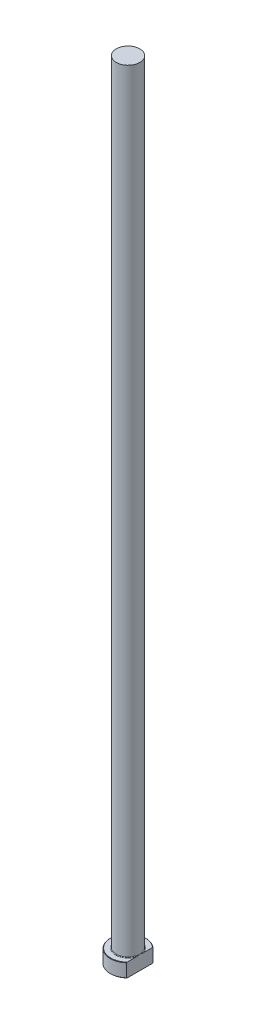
from build123d import *
from build123d.topology import SkipClean

# Parameters (mm, degrees)
CHAMFER1_SIZE = 0.2
FILLET1_R     = 0.3
KEY_DEPTH     = 401.202448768


with BuildPart() as part:
    # Sketch1 → Revolve1 (revolve)
    with BuildSketch(Plane.XY, mode=Mode.PRIVATE) as revolve1_sk:
        Polygon((0, 0), (-9, 0), (-9, 7), (-6, 7), (-6, 400), (0, 400), align=None)
    revolve(revolve1_sk.sketch.rotate(Axis((0, 259.958771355, 0), (0, -1, 0)), 270), axis=Axis((0, 259.958771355, 0), (0, -1, 0)))

    # Chamfer1
    chamfer1_edges = [part.edges().sort_by_distance(p)[0] for p in [
        (0, 7, -9),
        (0, 0, -9),
    ]]
    chamfer(chamfer1_edges, length=CHAMFER1_SIZE)

    # Fillet1
    fillet1_edges = [part.edges().sort_by_distance(p)[0] for p in [
        (0, 7, -6),
    ]]
    fillet(fillet1_edges, radius=FILLET1_R)

    # Sketch2 → KEY (cut, through all)
    with SkipClean():  # the faces are left unmerged after this step: merging them gives an invalid solid
        with BuildSketch(Plane(origin=(0, 0, 0), x_dir=(1, 0, 0), z_dir=(0, 1, 0))):
            with BuildLine():
                Line((6, 6.708203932), (6, -6.708203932))
                ThreePointArc((6, -6.708203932), (9, 0), (6, 6.708203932))
            make_face()
        extrude(amount=KEY_DEPTH, mode=Mode.SUBTRACT)


solid = part.part
